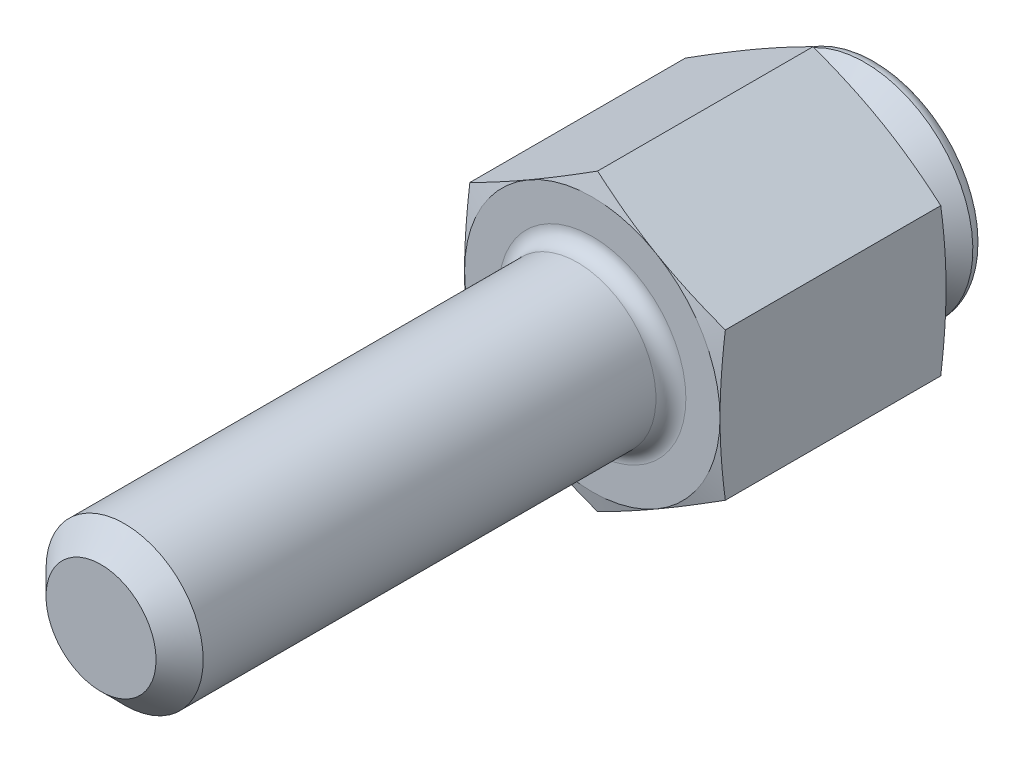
ISO-10303-21;
HEADER;
FILE_DESCRIPTION(('STEP AP214'),'2;1');
FILE_NAME('part.step','',(''),(''),'','','');
FILE_SCHEMA(('AUTOMOTIVE_DESIGN { 1 0 10303 214 1 1 1 1 }'));
ENDSEC;
DATA;
#1=APPLICATION_CONTEXT('core data for automotive mechanical design processes');
#2=APPLICATION_PROTOCOL_DEFINITION('international standard','automotive_design',2000,#1);
#3=PRODUCT_CONTEXT('',#1,'mechanical');
#4=PRODUCT('Part','Part','',(#3));
#5=PRODUCT_RELATED_PRODUCT_CATEGORY('part','',(#4));
#6=PRODUCT_DEFINITION_FORMATION('','',#4);
#7=PRODUCT_DEFINITION_CONTEXT('part definition',#1,'design');
#8=PRODUCT_DEFINITION('design','',#6,#7);
#9=PRODUCT_DEFINITION_SHAPE('','',#8);
#10=(LENGTH_UNIT() NAMED_UNIT(*) SI_UNIT(.MILLI.,.METRE.));
#11=(NAMED_UNIT(*) PLANE_ANGLE_UNIT() SI_UNIT($,.RADIAN.));
#12=(NAMED_UNIT(*) SI_UNIT($,.STERADIAN.) SOLID_ANGLE_UNIT());
#13=UNCERTAINTY_MEASURE_WITH_UNIT(LENGTH_MEASURE(1.E-05),#10,'distance_accuracy_value','');
#14=(GEOMETRIC_REPRESENTATION_CONTEXT(3) GLOBAL_UNCERTAINTY_ASSIGNED_CONTEXT((#13)) GLOBAL_UNIT_ASSIGNED_CONTEXT((#10,
#11,#12)) REPRESENTATION_CONTEXT('',''));
#15=CARTESIAN_POINT('',(0.,0.,0.));
#16=DIRECTION('',(0.,0.,1.));
#17=DIRECTION('',(1.,0.,0.));
#18=AXIS2_PLACEMENT_3D('',#15,#16,#17);
#19=CARTESIAN_POINT('',(0.,0.,4.2191999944));
#20=DIRECTION('',(0.,0.,-1.));
#21=DIRECTION('',(-1.,0.,0.));
#22=AXIS2_PLACEMENT_3D('',#19,#20,#21);
#23=PLANE('',#22);
#24=CARTESIAN_POINT('',(0.,0.,4.2191999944));
#25=DIRECTION('',(0.,0.,-1.));
#26=DIRECTION('',(-1.,0.,0.));
#27=AXIS2_PLACEMENT_3D('',#24,#25,#26);
#28=CIRCLE('',#27,5.0673);
#29=CARTESIAN_POINT('',(-5.0673,0.,4.2191999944));
#30=VERTEX_POINT('',#29);
#31=EDGE_CURVE('E128',#30,#30,#28,.F.);
#32=ORIENTED_EDGE('',*,*,#31,.F.);
#33=EDGE_LOOP('',(#32));
#34=FACE_BOUND('',#33,.T.);
#35=CARTESIAN_POINT('',(0.,0.,4.2191999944));
#36=DIRECTION('',(0.,0.,-1.));
#37=DIRECTION('',(-0.968186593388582,-0.250229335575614,0.));
#38=AXIS2_PLACEMENT_3D('',#35,#36,#37);
#39=CIRCLE('',#38,4.44877097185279);
#40=CARTESIAN_POINT('',(-1.1132130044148,4.30724041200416,4.2191999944));
#41=VERTEX_POINT('',#40);
#42=EDGE_CURVE('E9',#41,#41,#39,.T.);
#43=ORIENTED_EDGE('',*,*,#42,.F.);
#44=EDGE_LOOP('',(#43));
#45=FACE_BOUND('',#44,.T.);
#46=ADVANCED_FACE('F14',(#34,#45),#23,.T.);
#47=CARTESIAN_POINT('',(0.,0.,8.4355999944));
#48=DIRECTION('',(0.,0.,-1.));
#49=DIRECTION('',(-1.,0.,0.));
#50=AXIS2_PLACEMENT_3D('',#47,#48,#49);
#51=CYLINDRICAL_SURFACE('',#50,5.0673);
#52=ORIENTED_EDGE('',*,*,#31,.T.);
#53=EDGE_LOOP('',(#52));
#54=FACE_BOUND('',#53,.T.);
#55=CARTESIAN_POINT('',(0.,0.,3.2539999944));
#56=DIRECTION('',(0.,0.,-1.));
#57=DIRECTION('',(-1.,0.,0.));
#58=AXIS2_PLACEMENT_3D('',#55,#56,#57);
#59=CIRCLE('',#58,5.0673);
#60=CARTESIAN_POINT('',(-5.0673,0.,3.2539999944));
#61=VERTEX_POINT('',#60);
#62=EDGE_CURVE('E120',#61,#61,#59,.T.);
#63=ORIENTED_EDGE('',*,*,#62,.T.);
#64=EDGE_LOOP('',(#63));
#65=FACE_BOUND('',#64,.T.);
#66=ADVANCED_FACE('F158',(#54,#65),#51,.F.);
#67=CARTESIAN_POINT('',(0.,0.,3.2539999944));
#68=DIRECTION('',(0.,0.,-1.));
#69=DIRECTION('',(-1.,0.,0.));
#70=AXIS2_PLACEMENT_3D('',#67,#68,#69);
#71=CONICAL_SURFACE('',#70,5.0673,0.785398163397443);
#72=CARTESIAN_POINT('',(0.,0.,2.9999999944));
#73=DIRECTION('',(0.,0.,-1.));
#74=DIRECTION('',(-1.,0.,0.));
#75=AXIS2_PLACEMENT_3D('',#72,#73,#74);
#76=CIRCLE('',#75,5.3213);
#77=CARTESIAN_POINT('',(-5.3213,0.,2.9999999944));
#78=VERTEX_POINT('',#77);
#79=EDGE_CURVE('E255',#78,#78,#76,.F.);
#80=ORIENTED_EDGE('',*,*,#79,.F.);
#81=EDGE_LOOP('',(#80));
#82=FACE_BOUND('',#81,.T.);
#83=ORIENTED_EDGE('',*,*,#62,.F.);
#84=EDGE_LOOP('',(#83));
#85=FACE_BOUND('',#84,.T.);
#86=ADVANCED_FACE('F369',(#82,#85),#71,.F.);
#87=CARTESIAN_POINT('',(-6.5,3.75277674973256,2.9999999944));
#88=DIRECTION('',(0.,0.,-1.));
#89=DIRECTION('',(-1.,0.,0.));
#90=AXIS2_PLACEMENT_3D('',#87,#88,#89);
#91=PLANE('',#90);
#92=ORIENTED_EDGE('',*,*,#79,.T.);
#93=EDGE_LOOP('',(#92));
#94=FACE_BOUND('',#93,.T.);
#95=CARTESIAN_POINT('',(0.,0.,2.9999999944));
#96=DIRECTION('',(0.,0.,-1.));
#97=DIRECTION('',(-1.,0.,0.));
#98=AXIS2_PLACEMENT_3D('',#95,#96,#97);
#99=CIRCLE('',#98,6.5);
#100=CARTESIAN_POINT('',(-3.25,-5.62916512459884,2.9999999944));
#101=VERTEX_POINT('',#100);
#102=CARTESIAN_POINT('',(-6.5,0.,2.9999999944));
#103=VERTEX_POINT('',#102);
#104=EDGE_CURVE('E123',#101,#103,#99,.T.);
#105=ORIENTED_EDGE('',*,*,#104,.T.);
#106=CARTESIAN_POINT('',(0.,0.,2.9999999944));
#107=DIRECTION('',(0.,0.,-1.));
#108=DIRECTION('',(-1.,0.,0.));
#109=AXIS2_PLACEMENT_3D('',#106,#107,#108);
#110=CIRCLE('',#109,6.5);
#111=CARTESIAN_POINT('',(-3.25,5.62916512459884,2.9999999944));
#112=VERTEX_POINT('',#111);
#113=EDGE_CURVE('E31',#103,#112,#110,.T.);
#114=ORIENTED_EDGE('',*,*,#113,.T.);
#115=CARTESIAN_POINT('',(3.25,5.62916512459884,2.9999999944));
#116=VERTEX_POINT('',#115);
#117=EDGE_CURVE('E112',#112,#116,#99,.T.);
#118=ORIENTED_EDGE('',*,*,#117,.T.);
#119=CARTESIAN_POINT('',(6.5,0.,2.9999999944));
#120=VERTEX_POINT('',#119);
#121=EDGE_CURVE('E121',#116,#120,#99,.T.);
#122=ORIENTED_EDGE('',*,*,#121,.T.);
#123=CARTESIAN_POINT('',(3.25,-5.62916512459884,2.9999999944));
#124=VERTEX_POINT('',#123);
#125=EDGE_CURVE('E427',#120,#124,#99,.T.);
#126=ORIENTED_EDGE('',*,*,#125,.T.);
#127=EDGE_CURVE('E252',#124,#101,#99,.T.);
#128=ORIENTED_EDGE('',*,*,#127,.T.);
#129=EDGE_LOOP('',(#105,#114,#118,#122,#126,#128));
#130=FACE_BOUND('',#129,.T.);
#131=ADVANCED_FACE('F125',(#94,#130),#91,.T.);
#132=CARTESIAN_POINT('',(0.,0.,2.9999999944));
#133=DIRECTION('',(0.,0.,1.));
#134=DIRECTION('',(1.,0.,0.));
#135=AXIS2_PLACEMENT_3D('',#132,#133,#134);
#136=CONICAL_SURFACE('',#135,6.5,1.30899693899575);
#137=ORIENTED_EDGE('',*,*,#121,.F.);
#138=CARTESIAN_POINT('',(6.5002,3.75266127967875,3.26946818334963));
#139=CARTESIAN_POINT('',(6.23025475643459,3.90851423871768,3.22768978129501));
#140=CARTESIAN_POINT('',(5.95982006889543,4.06464977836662,3.18976187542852));
#141=CARTESIAN_POINT('',(5.41799562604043,4.37747226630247,3.12312608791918));
#142=CARTESIAN_POINT('',(5.14660552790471,4.53415941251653,3.09442195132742));
#143=CARTESIAN_POINT('',(4.6045157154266,4.84713511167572,3.04790944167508));
#144=CARTESIAN_POINT('',(4.33381966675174,5.00342154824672,3.03004560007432));
#145=CARTESIAN_POINT('',(3.79208236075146,5.31619372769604,3.00609201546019));
#146=CARTESIAN_POINT('',(3.52104118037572,5.47267942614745,2.9999999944));
#147=CARTESIAN_POINT('',(2.97895881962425,5.78565082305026,2.9999999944));
#148=CARTESIAN_POINT('',(2.70791763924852,5.94213652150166,3.00609201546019));
#149=CARTESIAN_POINT('',(2.16618033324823,6.25490870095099,3.03004560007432));
#150=CARTESIAN_POINT('',(1.89548428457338,6.41119513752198,3.04790944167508));
#151=CARTESIAN_POINT('',(1.35339447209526,6.72417083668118,3.09442195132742));
#152=CARTESIAN_POINT('',(1.08200437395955,6.88085798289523,3.12312608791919));
#153=CARTESIAN_POINT('',(0.540179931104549,7.19368047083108,3.18976187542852));
#154=CARTESIAN_POINT('',(0.269745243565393,7.34981601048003,3.22768978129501));
#155=CARTESIAN_POINT('',(-0.000200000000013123,7.50566896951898,3.26946818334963));
#156=B_SPLINE_CURVE_WITH_KNOTS('',3,(#138,#139,#140,#141,#142,#143,#144,#145,#146,#147,#148,
#149,#150,#151,#152,#153,#154,#155),.UNSPECIFIED.,.F.,.F.,(4,2,2,2,2,2,2,2,4),(0.,
0.943529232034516,1.88744107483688,2.82648138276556,3.76533995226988,4.70419852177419,
5.64323882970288,6.58715067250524,7.53067990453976),.UNSPECIFIED.);
#157=CARTESIAN_POINT('',(6.5,3.75277674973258,3.26943724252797));
#158=VERTEX_POINT('',#157);
#159=EDGE_CURVE('E135',#158,#116,#156,.T.);
#160=ORIENTED_EDGE('',*,*,#159,.F.);
#161=CARTESIAN_POINT('',(6.5,-10.0044654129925,4.45512613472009));
#162=CARTESIAN_POINT('',(6.50000000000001,-9.70867848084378,4.38868337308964));
#163=CARTESIAN_POINT('',(6.50000000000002,-9.412708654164,4.32304045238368));
#164=CARTESIAN_POINT('',(6.50000000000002,-8.82031321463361,4.19378618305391));
#165=CARTESIAN_POINT('',(6.50000000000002,-8.523887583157,4.13017491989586));
#166=CARTESIAN_POINT('',(6.50000000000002,-7.9302364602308,4.0053628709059));
#167=CARTESIAN_POINT('',(6.50000000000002,-7.63301047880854,3.94416440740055));
#168=CARTESIAN_POINT('',(6.50000000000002,-7.03794541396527,3.82482619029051));
#169=CARTESIAN_POINT('',(6.50000000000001,-6.74010633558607,3.76668641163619));
#170=CARTESIAN_POINT('',(6.50000000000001,-6.14610081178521,3.65464722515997));
#171=CARTESIAN_POINT('',(6.50000000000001,-5.8499401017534,3.6007175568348));
#172=CARTESIAN_POINT('',(6.50000000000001,-5.25681519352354,3.49748246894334));
#173=CARTESIAN_POINT('',(6.50000000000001,-4.95985101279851,3.44817694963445));
#174=CARTESIAN_POINT('',(6.50000000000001,-4.36505179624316,3.3552838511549));
#175=CARTESIAN_POINT('',(6.50000000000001,-4.06721684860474,3.31169571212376));
#176=CARTESIAN_POINT('',(6.50000000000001,-3.47059684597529,3.23150777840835));
#177=CARTESIAN_POINT('',(6.5,-3.17181178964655,3.19490799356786));
#178=CARTESIAN_POINT('',(6.5,-2.56988519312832,3.12971568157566));
#179=CARTESIAN_POINT('',(6.50000000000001,-2.26673301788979,3.10121990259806));
#180=CARTESIAN_POINT('',(6.50000000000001,-1.65965008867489,3.0541914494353));
#181=CARTESIAN_POINT('',(6.50000000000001,-1.3557193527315,3.03565854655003));
#182=CARTESIAN_POINT('',(6.50000000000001,-0.747523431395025,3.00963573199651));
#183=CARTESIAN_POINT('',(6.50000000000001,-0.44325847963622,3.00214046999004));
#184=CARTESIAN_POINT('',(6.50000000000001,0.165338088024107,2.99865544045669));
#185=CARTESIAN_POINT('',(6.50000000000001,0.469669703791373,3.00266564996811));
#186=CARTESIAN_POINT('',(6.5,1.07910960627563,3.02196777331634));
#187=CARTESIAN_POINT('',(6.5,1.3842165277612,3.03730192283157));
#188=CARTESIAN_POINT('',(6.5,1.99372315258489,3.07837085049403));
#189=CARTESIAN_POINT('',(6.5,2.29812283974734,3.10410586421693));
#190=CARTESIAN_POINT('',(6.5,2.90621194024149,3.16465760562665));
#191=CARTESIAN_POINT('',(6.5,3.20990073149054,3.19948048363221));
#192=CARTESIAN_POINT('',(6.5,3.8162976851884,3.27673535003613));
#193=CARTESIAN_POINT('',(6.5,4.11900584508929,3.31916735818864));
#194=CARTESIAN_POINT('',(6.5,4.71530607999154,3.40902902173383));
#195=CARTESIAN_POINT('',(6.5,5.00892342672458,3.45629261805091));
#196=CARTESIAN_POINT('',(6.5,5.59535016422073,3.5556148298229));
#197=CARTESIAN_POINT('',(6.5,5.88815952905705,3.60767359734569));
#198=CARTESIAN_POINT('',(6.5,6.47308937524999,3.71567333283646));
#199=CARTESIAN_POINT('',(6.5,6.7652097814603,3.77161470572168));
#200=CARTESIAN_POINT('',(6.49999999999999,7.3488323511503,3.88664229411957));
#201=CARTESIAN_POINT('',(6.49999999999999,7.64033450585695,3.94572855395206));
#202=CARTESIAN_POINT('',(6.49999999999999,8.51421406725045,4.12682171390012));
#203=CARTESIAN_POINT('',(6.49999999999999,9.0958022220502,4.25263228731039));
#204=CARTESIAN_POINT('',(6.49999999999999,10.2574156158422,4.51102121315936));
#205=CARTESIAN_POINT('',(6.49999999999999,10.8374409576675,4.64359910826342));
#206=CARTESIAN_POINT('',(6.49999999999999,11.9903925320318,4.91207172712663));
#207=CARTESIAN_POINT('',(6.49999999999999,12.5633300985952,5.04791790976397));
#208=CARTESIAN_POINT('',(6.49999999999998,13.7084200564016,5.32292192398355));
#209=CARTESIAN_POINT('',(6.49999999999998,14.2805724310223,5.46207982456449));
#210=CARTESIAN_POINT('',(6.49999999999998,15.4235044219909,5.74263306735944));
#211=CARTESIAN_POINT('',(6.49999999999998,15.9942848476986,5.88402511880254));
#212=CARTESIAN_POINT('',(6.49999999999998,17.1353614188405,6.16866615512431));
#213=CARTESIAN_POINT('',(6.49999999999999,17.7056575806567,6.31191507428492));
#214=CARTESIAN_POINT('',(6.5,18.2757873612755,6.45581528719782));
#215=B_SPLINE_CURVE_WITH_KNOTS('',3,(#161,#162,#163,#164,#165,#166,#167,#168,#169,#170,#171,
#172,#173,#174,#175,#176,#177,#178,#179,#180,#181,#182,#183,#184,#185,#186,#187,#188,#189,#190,
#191,#192,#193,#194,#195,#196,#197,#198,#199,#200,#201,#202,#203,#204,#205,#206,#207,#208,#209,
#210,#211,#212,#213,#214),.UNSPECIFIED.,.F.,.F.,(4,2,2,2,2,2,2,2,2,2,2,2,2,2,2,2,2,2,2,2,2,2,2,
2,2,2,4),(0.,0.909476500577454,1.81899120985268,2.72936096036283,3.63972325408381,
4.54278656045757,5.44583038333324,6.34878571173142,7.25174231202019,8.1650649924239,
9.07836670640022,9.991225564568,10.9040826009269,11.8203616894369,12.7366615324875,
13.6535831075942,14.5705070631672,15.4626502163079,16.3548216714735,17.2470863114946,
18.1393635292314,19.9244135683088,21.7093431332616,23.4757957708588,25.2422852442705,
27.0063787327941,28.7704099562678),.UNSPECIFIED.);
#216=EDGE_CURVE('E169',#120,#158,#215,.T.);
#217=ORIENTED_EDGE('',*,*,#216,.F.);
#218=EDGE_LOOP('',(#137,#160,#217));
#219=FACE_BOUND('',#218,.T.);
#220=ADVANCED_FACE('F157',(#219),#136,.T.);
#221=ORIENTED_EDGE('',*,*,#125,.F.);
#222=CARTESIAN_POINT('',(6.5,-3.75277674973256,3.26943724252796));
#223=VERTEX_POINT('',#222);
#224=EDGE_CURVE('E415',#223,#120,#215,.T.);
#225=ORIENTED_EDGE('',*,*,#224,.F.);
#226=CARTESIAN_POINT('',(-0.000200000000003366,-7.50566896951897,3.26946818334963));
#227=CARTESIAN_POINT('',(0.269745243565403,-7.34981601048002,3.22768978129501));
#228=CARTESIAN_POINT('',(0.54017993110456,-7.19368047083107,3.18976187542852));
#229=CARTESIAN_POINT('',(1.08200437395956,-6.88085798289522,3.12312608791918));
#230=CARTESIAN_POINT('',(1.35339447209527,-6.72417083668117,3.09442195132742));
#231=CARTESIAN_POINT('',(1.89548428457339,-6.41119513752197,3.04790944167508));
#232=CARTESIAN_POINT('',(2.16618033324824,-6.25490870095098,3.03004560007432));
#233=CARTESIAN_POINT('',(2.70791763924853,-5.94213652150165,3.00609201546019));
#234=CARTESIAN_POINT('',(2.97895881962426,-5.78565082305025,2.9999999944));
#235=CARTESIAN_POINT('',(3.52104118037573,-5.47267942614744,2.9999999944));
#236=CARTESIAN_POINT('',(3.79208236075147,-5.31619372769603,3.00609201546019));
#237=CARTESIAN_POINT('',(4.33381966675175,-5.0034215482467,3.03004560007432));
#238=CARTESIAN_POINT('',(4.60451571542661,-4.84713511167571,3.04790944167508));
#239=CARTESIAN_POINT('',(5.14660552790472,-4.53415941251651,3.09442195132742));
#240=CARTESIAN_POINT('',(5.41799562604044,-4.37747226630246,3.12312608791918));
#241=CARTESIAN_POINT('',(5.95982006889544,-4.06464977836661,3.18976187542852));
#242=CARTESIAN_POINT('',(6.23025475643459,-3.90851423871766,3.22768978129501));
#243=CARTESIAN_POINT('',(6.5002,-3.75266127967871,3.26946818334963));
#244=B_SPLINE_CURVE_WITH_KNOTS('',3,(#226,#227,#228,#229,#230,#231,#232,#233,#234,#235,#236,
#237,#238,#239,#240,#241,#242,#243),.UNSPECIFIED.,.F.,.F.,(4,2,2,2,2,2,2,2,4),(0.,
0.943529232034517,1.88744107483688,2.82648138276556,3.76533995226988,4.7041985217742,
5.64323882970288,6.58715067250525,7.53067990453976),.UNSPECIFIED.);
#245=EDGE_CURVE('E176',#124,#223,#244,.T.);
#246=ORIENTED_EDGE('',*,*,#245,.F.);
#247=EDGE_LOOP('',(#221,#225,#246));
#248=FACE_BOUND('',#247,.T.);
#249=ADVANCED_FACE('F570',(#248),#136,.T.);
#250=ORIENTED_EDGE('',*,*,#127,.F.);
#251=CARTESIAN_POINT('',(0.,-7.50555349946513,3.26943724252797));
#252=VERTEX_POINT('',#251);
#253=EDGE_CURVE('E191',#252,#124,#244,.T.);
#254=ORIENTED_EDGE('',*,*,#253,.F.);
#255=CARTESIAN_POINT('',(-6.5002,-3.75266127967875,3.26946818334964));
#256=CARTESIAN_POINT('',(-6.23025475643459,-3.90851423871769,3.22768978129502));
#257=CARTESIAN_POINT('',(-5.95982006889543,-4.06464977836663,3.18976187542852));
#258=CARTESIAN_POINT('',(-5.41799562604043,-4.37747226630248,3.12312608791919));
#259=CARTESIAN_POINT('',(-5.14660552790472,-4.53415941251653,3.09442195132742));
#260=CARTESIAN_POINT('',(-4.60451571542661,-4.84713511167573,3.04790944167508));
#261=CARTESIAN_POINT('',(-4.33381966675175,-5.00342154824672,3.03004560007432));
#262=CARTESIAN_POINT('',(-3.79208236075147,-5.31619372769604,3.0060920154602));
#263=CARTESIAN_POINT('',(-3.52104118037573,-5.47267942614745,2.9999999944));
#264=CARTESIAN_POINT('',(-2.97895881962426,-5.78565082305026,2.9999999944));
#265=CARTESIAN_POINT('',(-2.70791763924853,-5.94213652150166,3.0060920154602));
#266=CARTESIAN_POINT('',(-2.16618033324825,-6.25490870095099,3.03004560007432));
#267=CARTESIAN_POINT('',(-1.89548428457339,-6.41119513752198,3.04790944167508));
#268=CARTESIAN_POINT('',(-1.35339447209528,-6.72417083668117,3.09442195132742));
#269=CARTESIAN_POINT('',(-1.08200437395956,-6.88085798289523,3.12312608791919));
#270=CARTESIAN_POINT('',(-0.540179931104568,-7.19368047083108,3.18976187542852));
#271=CARTESIAN_POINT('',(-0.269745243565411,-7.34981601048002,3.22768978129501));
#272=CARTESIAN_POINT('',(0.000199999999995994,-7.50566896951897,3.26946818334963));
#273=B_SPLINE_CURVE_WITH_KNOTS('',3,(#255,#256,#257,#258,#259,#260,#261,#262,#263,#264,#265,
#266,#267,#268,#269,#270,#271,#272),.UNSPECIFIED.,.F.,.F.,(4,2,2,2,2,2,2,2,4),(0.,
0.943529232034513,1.88744107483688,2.82648138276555,3.76533995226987,4.70419852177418,
5.64323882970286,6.58715067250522,7.53067990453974),.UNSPECIFIED.);
#274=EDGE_CURVE('E183',#101,#252,#273,.T.);
#275=ORIENTED_EDGE('',*,*,#274,.F.);
#276=EDGE_LOOP('',(#250,#254,#275));
#277=FACE_BOUND('',#276,.T.);
#278=ADVANCED_FACE('F562',(#277),#136,.T.);
#279=ORIENTED_EDGE('',*,*,#104,.F.);
#280=CARTESIAN_POINT('',(-6.5,-3.75277674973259,3.26943724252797));
#281=VERTEX_POINT('',#280);
#282=EDGE_CURVE('E190',#281,#101,#273,.T.);
#283=ORIENTED_EDGE('',*,*,#282,.F.);
#284=CARTESIAN_POINT('',(-6.5,-10.0044654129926,4.4551261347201));
#285=CARTESIAN_POINT('',(-6.49999999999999,-9.70867848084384,4.38868337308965));
#286=CARTESIAN_POINT('',(-6.49999999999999,-9.41270865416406,4.32304045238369));
#287=CARTESIAN_POINT('',(-6.49999999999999,-8.82031321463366,4.19378618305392));
#288=CARTESIAN_POINT('',(-6.49999999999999,-8.52388758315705,4.13017491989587));
#289=CARTESIAN_POINT('',(-6.49999999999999,-7.93023646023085,4.0053628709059));
#290=CARTESIAN_POINT('',(-6.49999999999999,-7.63301047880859,3.94416440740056));
#291=CARTESIAN_POINT('',(-6.49999999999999,-7.03794541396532,3.82482619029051));
#292=CARTESIAN_POINT('',(-6.5,-6.74010633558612,3.76668641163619));
#293=CARTESIAN_POINT('',(-6.5,-6.14610081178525,3.65464722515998));
#294=CARTESIAN_POINT('',(-6.5,-5.84994010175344,3.60071755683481));
#295=CARTESIAN_POINT('',(-6.5,-5.25681519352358,3.49748246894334));
#296=CARTESIAN_POINT('',(-6.5,-4.95985101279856,3.44817694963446));
#297=CARTESIAN_POINT('',(-6.5,-4.3650517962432,3.35528385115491));
#298=CARTESIAN_POINT('',(-6.5,-4.06721684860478,3.31169571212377));
#299=CARTESIAN_POINT('',(-6.5,-3.47059684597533,3.23150777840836));
#300=CARTESIAN_POINT('',(-6.5,-3.17181178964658,3.19490799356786));
#301=CARTESIAN_POINT('',(-6.5,-2.56988519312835,3.12971568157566));
#302=CARTESIAN_POINT('',(-6.5,-2.26673301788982,3.10121990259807));
#303=CARTESIAN_POINT('',(-6.5,-1.65965008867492,3.05419144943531));
#304=CARTESIAN_POINT('',(-6.5,-1.35571935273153,3.03565854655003));
#305=CARTESIAN_POINT('',(-6.5,-0.747523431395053,3.00963573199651));
#306=CARTESIAN_POINT('',(-6.5,-0.443258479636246,3.00214046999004));
#307=CARTESIAN_POINT('',(-6.50000000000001,0.165338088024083,2.99865544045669));
#308=CARTESIAN_POINT('',(-6.50000000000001,0.46966970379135,3.00266564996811));
#309=CARTESIAN_POINT('',(-6.50000000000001,1.07910960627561,3.02196777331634));
#310=CARTESIAN_POINT('',(-6.50000000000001,1.38421652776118,3.03730192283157));
#311=CARTESIAN_POINT('',(-6.50000000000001,1.99372315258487,3.07837085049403));
#312=CARTESIAN_POINT('',(-6.50000000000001,2.29812283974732,3.10410586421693));
#313=CARTESIAN_POINT('',(-6.50000000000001,2.90621194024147,3.16465760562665));
#314=CARTESIAN_POINT('',(-6.50000000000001,3.20990073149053,3.19948048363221));
#315=CARTESIAN_POINT('',(-6.50000000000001,3.81629768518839,3.27673535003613));
#316=CARTESIAN_POINT('',(-6.5,4.11900584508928,3.31916735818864));
#317=CARTESIAN_POINT('',(-6.5,4.71530607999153,3.40902902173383));
#318=CARTESIAN_POINT('',(-6.50000000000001,5.00892342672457,3.45629261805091));
#319=CARTESIAN_POINT('',(-6.50000000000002,5.59535016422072,3.5556148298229));
#320=CARTESIAN_POINT('',(-6.50000000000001,5.88815952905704,3.60767359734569));
#321=CARTESIAN_POINT('',(-6.50000000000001,6.47308937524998,3.71567333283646));
#322=CARTESIAN_POINT('',(-6.50000000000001,6.76520978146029,3.77161470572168));
#323=CARTESIAN_POINT('',(-6.50000000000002,7.34883235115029,3.88664229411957));
#324=CARTESIAN_POINT('',(-6.50000000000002,7.64033450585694,3.94572855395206));
#325=CARTESIAN_POINT('',(-6.50000000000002,8.51421406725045,4.12682171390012));
#326=CARTESIAN_POINT('',(-6.50000000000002,9.0958022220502,4.25263228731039));
#327=CARTESIAN_POINT('',(-6.50000000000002,10.2574156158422,4.51102121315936));
#328=CARTESIAN_POINT('',(-6.50000000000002,10.8374409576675,4.64359910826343));
#329=CARTESIAN_POINT('',(-6.50000000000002,11.9903925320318,4.91207172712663));
#330=CARTESIAN_POINT('',(-6.50000000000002,12.5633300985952,5.04791790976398));
#331=CARTESIAN_POINT('',(-6.50000000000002,13.7084200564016,5.32292192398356));
#332=CARTESIAN_POINT('',(-6.50000000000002,14.2805724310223,5.46207982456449));
#333=CARTESIAN_POINT('',(-6.50000000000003,15.4235044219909,5.74263306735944));
#334=CARTESIAN_POINT('',(-6.50000000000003,15.9942848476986,5.88402511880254));
#335=CARTESIAN_POINT('',(-6.50000000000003,17.1353614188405,6.16866615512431));
#336=CARTESIAN_POINT('',(-6.50000000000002,17.7056575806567,6.31191507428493));
#337=CARTESIAN_POINT('',(-6.5,18.2757873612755,6.45581528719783));
#338=B_SPLINE_CURVE_WITH_KNOTS('',3,(#284,#285,#286,#287,#288,#289,#290,#291,#292,#293,#294,
#295,#296,#297,#298,#299,#300,#301,#302,#303,#304,#305,#306,#307,#308,#309,#310,#311,#312,#313,
#314,#315,#316,#317,#318,#319,#320,#321,#322,#323,#324,#325,#326,#327,#328,#329,#330,#331,#332,
#333,#334,#335,#336,#337),.UNSPECIFIED.,.F.,.F.,(4,2,2,2,2,2,2,2,2,2,2,2,2,2,2,2,2,2,2,2,2,2,2,
2,2,2,4),(0.,0.909476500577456,1.81899120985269,2.72936096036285,3.63972325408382,
4.54278656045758,5.44583038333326,6.34878571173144,7.25174231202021,8.16506499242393,
9.07836670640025,9.99122556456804,10.9040826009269,11.820361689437,12.7366615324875,
13.6535831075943,14.5705070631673,15.462650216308,16.3548216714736,17.2470863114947,
18.1393635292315,19.9244135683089,21.7093431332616,23.4757957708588,25.2422852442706,
27.0063787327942,28.7704099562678),.UNSPECIFIED.);
#339=EDGE_CURVE('E192',#103,#281,#338,.F.);
#340=ORIENTED_EDGE('',*,*,#339,.F.);
#341=EDGE_LOOP('',(#279,#283,#340));
#342=FACE_BOUND('',#341,.T.);
#343=ADVANCED_FACE('F554',(#342),#136,.T.);
#344=CARTESIAN_POINT('',(0.000199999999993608,7.50566896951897,3.26946818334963));
#345=CARTESIAN_POINT('',(-0.269745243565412,7.34981601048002,3.22768978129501));
#346=CARTESIAN_POINT('',(-0.540179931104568,7.19368047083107,3.18976187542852));
#347=CARTESIAN_POINT('',(-1.08200437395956,6.88085798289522,3.12312608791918));
#348=CARTESIAN_POINT('',(-1.35339447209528,6.72417083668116,3.09442195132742));
#349=CARTESIAN_POINT('',(-1.89548428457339,6.41119513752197,3.04790944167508));
#350=CARTESIAN_POINT('',(-2.16618033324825,6.25490870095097,3.03004560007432));
#351=CARTESIAN_POINT('',(-2.70791763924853,5.94213652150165,3.00609201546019));
#352=CARTESIAN_POINT('',(-2.97895881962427,5.78565082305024,2.9999999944));
#353=CARTESIAN_POINT('',(-3.52104118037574,5.47267942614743,2.9999999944));
#354=CARTESIAN_POINT('',(-3.79208236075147,5.31619372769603,3.00609201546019));
#355=CARTESIAN_POINT('',(-4.33381966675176,5.0034215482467,3.03004560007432));
#356=CARTESIAN_POINT('',(-4.60451571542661,4.84713511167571,3.04790944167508));
#357=CARTESIAN_POINT('',(-5.14660552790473,4.53415941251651,3.09442195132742));
#358=CARTESIAN_POINT('',(-5.41799562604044,4.37747226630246,3.12312608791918));
#359=CARTESIAN_POINT('',(-5.95982006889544,4.06464977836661,3.18976187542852));
#360=CARTESIAN_POINT('',(-6.23025475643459,3.90851423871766,3.22768978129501));
#361=CARTESIAN_POINT('',(-6.5002,3.75266127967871,3.26946818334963));
#362=B_SPLINE_CURVE_WITH_KNOTS('',3,(#344,#345,#346,#347,#348,#349,#350,#351,#352,#353,#354,
#355,#356,#357,#358,#359,#360,#361),.UNSPECIFIED.,.F.,.F.,(4,2,2,2,2,2,2,2,4),(0.,
0.943529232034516,1.88744107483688,2.82648138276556,3.76533995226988,4.70419852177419,
5.64323882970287,6.58715067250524,7.53067990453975),.UNSPECIFIED.);
#363=CARTESIAN_POINT('',(-6.5,3.75277674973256,3.26943724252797));
#364=VERTEX_POINT('',#363);
#365=EDGE_CURVE('E101',#112,#364,#362,.T.);
#366=ORIENTED_EDGE('',*,*,#365,.F.);
#367=ORIENTED_EDGE('',*,*,#113,.F.);
#368=EDGE_CURVE('E35',#364,#103,#338,.F.);
#369=ORIENTED_EDGE('',*,*,#368,.F.);
#370=EDGE_LOOP('',(#366,#367,#369));
#371=FACE_BOUND('',#370,.T.);
#372=ADVANCED_FACE('F103',(#371),#136,.T.);
#373=ORIENTED_EDGE('',*,*,#117,.F.);
#374=CARTESIAN_POINT('',(0.,7.50555349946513,3.26943724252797));
#375=VERTEX_POINT('',#374);
#376=EDGE_CURVE('E108',#375,#112,#362,.T.);
#377=ORIENTED_EDGE('',*,*,#376,.F.);
#378=EDGE_CURVE('E115',#116,#375,#156,.T.);
#379=ORIENTED_EDGE('',*,*,#378,.F.);
#380=EDGE_LOOP('',(#373,#377,#379));
#381=FACE_BOUND('',#380,.T.);
#382=ADVANCED_FACE('F113',(#381),#136,.T.);
#383=CARTESIAN_POINT('',(0.,7.50555349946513,14.4999999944));
#384=DIRECTION('',(0.5,0.86602540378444,0.));
#385=DIRECTION('',(0.86602540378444,-0.5,0.));
#386=AXIS2_PLACEMENT_3D('',#383,#384,#385);
#387=PLANE('',#386);
#388=DIRECTION('',(0.,0.,-1.));
#389=VECTOR('',#388,1.);
#390=CARTESIAN_POINT('',(6.5,3.75277674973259,14.4999999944));
#391=LINE('',#390,#389);
#392=CARTESIAN_POINT('',(6.5,3.75277674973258,14.230562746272));
#393=VERTEX_POINT('',#392);
#394=EDGE_CURVE('E242',#393,#158,#391,.T.);
#395=ORIENTED_EDGE('',*,*,#394,.T.);
#396=ORIENTED_EDGE('',*,*,#159,.T.);
#397=ORIENTED_EDGE('',*,*,#378,.T.);
#398=DIRECTION('',(0.,0.,-1.));
#399=VECTOR('',#398,1.);
#400=CARTESIAN_POINT('',(0.,7.50555349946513,14.4999999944));
#401=LINE('',#400,#399);
#402=CARTESIAN_POINT('',(0.,7.50555349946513,14.230562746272));
#403=VERTEX_POINT('',#402);
#404=EDGE_CURVE('E134',#403,#375,#401,.T.);
#405=ORIENTED_EDGE('',*,*,#404,.F.);
#406=CARTESIAN_POINT('',(-0.000200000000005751,7.50566896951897,14.2305318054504));
#407=CARTESIAN_POINT('',(0.269745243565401,7.34981601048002,14.272310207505));
#408=CARTESIAN_POINT('',(0.540179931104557,7.19368047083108,14.3102381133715));
#409=CARTESIAN_POINT('',(1.08200437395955,6.88085798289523,14.3768739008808));
#410=CARTESIAN_POINT('',(1.35339447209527,6.72417083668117,14.4055780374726));
#411=CARTESIAN_POINT('',(1.89548428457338,6.41119513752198,14.4520905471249));
#412=CARTESIAN_POINT('',(2.16618033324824,6.25490870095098,14.4699543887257));
#413=CARTESIAN_POINT('',(2.70791763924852,5.94213652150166,14.4939079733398));
#414=CARTESIAN_POINT('',(2.97895881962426,5.78565082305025,14.4999999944));
#415=CARTESIAN_POINT('',(3.52104118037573,5.47267942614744,14.4999999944));
#416=CARTESIAN_POINT('',(3.79208236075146,5.31619372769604,14.4939079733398));
#417=CARTESIAN_POINT('',(4.33381966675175,5.00342154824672,14.4699543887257));
#418=CARTESIAN_POINT('',(4.6045157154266,4.84713511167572,14.4520905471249));
#419=CARTESIAN_POINT('',(5.14660552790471,4.53415941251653,14.4055780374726));
#420=CARTESIAN_POINT('',(5.41799562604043,4.37747226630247,14.3768739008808));
#421=CARTESIAN_POINT('',(5.95982006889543,4.06464977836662,14.3102381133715));
#422=CARTESIAN_POINT('',(6.23025475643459,3.90851423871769,14.272310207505));
#423=CARTESIAN_POINT('',(6.5002,3.75266127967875,14.2305318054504));
#424=B_SPLINE_CURVE_WITH_KNOTS('',3,(#406,#407,#408,#409,#410,#411,#412,#413,#414,#415,#416,
#417,#418,#419,#420,#421,#422,#423),.UNSPECIFIED.,.F.,.F.,(4,2,2,2,2,2,2,2,4),(0.,
0.943529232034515,1.88744107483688,2.82648138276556,3.76533995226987,4.70419852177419,
5.64323882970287,6.58715067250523,7.53067990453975),.UNSPECIFIED.);
#425=CARTESIAN_POINT('',(3.25,5.62916512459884,14.4999999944));
#426=VERTEX_POINT('',#425);
#427=EDGE_CURVE('E384',#403,#426,#424,.T.);
#428=ORIENTED_EDGE('',*,*,#427,.T.);
#429=EDGE_CURVE('E392',#426,#393,#424,.T.);
#430=ORIENTED_EDGE('',*,*,#429,.T.);
#431=EDGE_LOOP('',(#395,#396,#397,#405,#428,#430));
#432=FACE_BOUND('',#431,.T.);
#433=ADVANCED_FACE('F156',(#432),#387,.T.);
#434=CARTESIAN_POINT('',(6.5,3.75277674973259,14.4999999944));
#435=DIRECTION('',(1.,0.,0.));
#436=DIRECTION('',(0.,-1.,0.));
#437=AXIS2_PLACEMENT_3D('',#434,#435,#436);
#438=PLANE('',#437);
#439=DIRECTION('',(0.,0.,-1.));
#440=VECTOR('',#439,1.);
#441=CARTESIAN_POINT('',(6.5,-3.75277674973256,14.4999999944));
#442=LINE('',#441,#440);
#443=CARTESIAN_POINT('',(6.5,-3.75277674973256,14.230562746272));
#444=VERTEX_POINT('',#443);
#445=EDGE_CURVE('E239',#444,#223,#442,.T.);
#446=ORIENTED_EDGE('',*,*,#445,.T.);
#447=ORIENTED_EDGE('',*,*,#224,.T.);
#448=ORIENTED_EDGE('',*,*,#216,.T.);
#449=ORIENTED_EDGE('',*,*,#394,.F.);
#450=CARTESIAN_POINT('',(6.5,-10.0044654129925,13.0448738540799));
#451=CARTESIAN_POINT('',(6.50000000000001,-9.70867848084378,13.1113166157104));
#452=CARTESIAN_POINT('',(6.50000000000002,-9.41270865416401,13.1769595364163));
#453=CARTESIAN_POINT('',(6.50000000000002,-8.82031321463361,13.3062138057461));
#454=CARTESIAN_POINT('',(6.50000000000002,-8.523887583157,13.3698250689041));
#455=CARTESIAN_POINT('',(6.50000000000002,-7.9302364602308,13.4946371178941));
#456=CARTESIAN_POINT('',(6.50000000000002,-7.63301047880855,13.5558355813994));
#457=CARTESIAN_POINT('',(6.50000000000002,-7.03794541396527,13.6751737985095));
#458=CARTESIAN_POINT('',(6.50000000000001,-6.74010633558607,13.7333135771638));
#459=CARTESIAN_POINT('',(6.50000000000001,-6.14610081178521,13.84535276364));
#460=CARTESIAN_POINT('',(6.50000000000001,-5.8499401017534,13.8992824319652));
#461=CARTESIAN_POINT('',(6.50000000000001,-5.25681519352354,14.0025175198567));
#462=CARTESIAN_POINT('',(6.50000000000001,-4.95985101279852,14.0518230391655));
#463=CARTESIAN_POINT('',(6.50000000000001,-4.36505179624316,14.1447161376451));
#464=CARTESIAN_POINT('',(6.50000000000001,-4.06721684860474,14.1883042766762));
#465=CARTESIAN_POINT('',(6.50000000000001,-3.47059684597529,14.2684922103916));
#466=CARTESIAN_POINT('',(6.5,-3.17181178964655,14.3050919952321));
#467=CARTESIAN_POINT('',(6.5,-2.56988519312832,14.3702843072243));
#468=CARTESIAN_POINT('',(6.50000000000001,-2.26673301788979,14.3987800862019));
#469=CARTESIAN_POINT('',(6.50000000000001,-1.65965008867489,14.4458085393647));
#470=CARTESIAN_POINT('',(6.50000000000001,-1.3557193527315,14.46434144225));
#471=CARTESIAN_POINT('',(6.50000000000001,-0.747523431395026,14.4903642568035));
#472=CARTESIAN_POINT('',(6.50000000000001,-0.443258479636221,14.49785951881));
#473=CARTESIAN_POINT('',(6.50000000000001,0.165338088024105,14.5013445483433));
#474=CARTESIAN_POINT('',(6.50000000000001,0.469669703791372,14.4973343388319));
#475=CARTESIAN_POINT('',(6.5,1.07910960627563,14.4780322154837));
#476=CARTESIAN_POINT('',(6.5,1.3842165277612,14.4626980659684));
#477=CARTESIAN_POINT('',(6.5,1.99372315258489,14.421629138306));
#478=CARTESIAN_POINT('',(6.5,2.29812283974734,14.3958941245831));
#479=CARTESIAN_POINT('',(6.5,2.90621194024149,14.3353423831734));
#480=CARTESIAN_POINT('',(6.5,3.20990073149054,14.3005195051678));
#481=CARTESIAN_POINT('',(6.5,3.8162976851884,14.2232646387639));
#482=CARTESIAN_POINT('',(6.5,4.11900584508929,14.1808326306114));
#483=CARTESIAN_POINT('',(6.5,4.71530607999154,14.0909709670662));
#484=CARTESIAN_POINT('',(6.5,5.00892342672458,14.0437073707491));
#485=CARTESIAN_POINT('',(6.5,5.59535016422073,13.9443851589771));
#486=CARTESIAN_POINT('',(6.5,5.88815952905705,13.8923263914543));
#487=CARTESIAN_POINT('',(6.5,6.47308937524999,13.7843266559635));
#488=CARTESIAN_POINT('',(6.5,6.76520978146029,13.7283852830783));
#489=CARTESIAN_POINT('',(6.49999999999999,7.3488323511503,13.6133576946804));
#490=CARTESIAN_POINT('',(6.49999999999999,7.64033450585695,13.5542714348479));
#491=CARTESIAN_POINT('',(6.49999999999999,8.51421406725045,13.3731782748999));
#492=CARTESIAN_POINT('',(6.49999999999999,9.0958022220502,13.2473677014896));
#493=CARTESIAN_POINT('',(6.49999999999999,10.2574156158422,12.9889787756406));
#494=CARTESIAN_POINT('',(6.49999999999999,10.8374409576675,12.8564008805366));
#495=CARTESIAN_POINT('',(6.49999999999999,11.9903925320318,12.5879282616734));
#496=CARTESIAN_POINT('',(6.49999999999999,12.5633300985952,12.452082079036));
#497=CARTESIAN_POINT('',(6.49999999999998,13.7084200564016,12.1770780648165));
#498=CARTESIAN_POINT('',(6.49999999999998,14.2805724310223,12.0379201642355));
#499=CARTESIAN_POINT('',(6.49999999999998,15.4235044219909,11.7573669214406));
#500=CARTESIAN_POINT('',(6.49999999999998,15.9942848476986,11.6159748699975));
#501=CARTESIAN_POINT('',(6.49999999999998,17.1353614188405,11.3313338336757));
#502=CARTESIAN_POINT('',(6.49999999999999,17.7056575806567,11.1880849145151));
#503=CARTESIAN_POINT('',(6.5,18.2757873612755,11.0441847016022));
#504=B_SPLINE_CURVE_WITH_KNOTS('',3,(#450,#451,#452,#453,#454,#455,#456,#457,#458,#459,#460,
#461,#462,#463,#464,#465,#466,#467,#468,#469,#470,#471,#472,#473,#474,#475,#476,#477,#478,#479,
#480,#481,#482,#483,#484,#485,#486,#487,#488,#489,#490,#491,#492,#493,#494,#495,#496,#497,#498,
#499,#500,#501,#502,#503),.UNSPECIFIED.,.F.,.F.,(4,2,2,2,2,2,2,2,2,2,2,2,2,2,2,2,2,2,2,2,2,2,2,
2,2,2,4),(0.,0.909476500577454,1.81899120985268,2.72936096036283,3.63972325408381,
4.54278656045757,5.44583038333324,6.34878571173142,7.25174231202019,8.16506499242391,
9.07836670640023,9.991225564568,10.9040826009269,11.8203616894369,12.7366615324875,
13.6535831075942,14.5705070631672,15.4626502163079,16.3548216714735,17.2470863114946,
18.1393635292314,19.9244135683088,21.7093431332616,23.4757957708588,25.2422852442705,
27.0063787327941,28.7704099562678),.UNSPECIFIED.);
#505=CARTESIAN_POINT('',(6.5,0.,14.4999999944));
#506=VERTEX_POINT('',#505);
#507=EDGE_CURVE('E217',#393,#506,#504,.F.);
#508=ORIENTED_EDGE('',*,*,#507,.T.);
#509=EDGE_CURVE('E231',#506,#444,#504,.F.);
#510=ORIENTED_EDGE('',*,*,#509,.T.);
#511=EDGE_LOOP('',(#446,#447,#448,#449,#508,#510));
#512=FACE_BOUND('',#511,.T.);
#513=ADVANCED_FACE('F400',(#512),#438,.T.);
#514=CARTESIAN_POINT('',(6.5,-3.75277674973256,14.4999999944));
#515=DIRECTION('',(0.5,-0.866025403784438,0.));
#516=DIRECTION('',(-0.866025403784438,-0.5,0.));
#517=AXIS2_PLACEMENT_3D('',#514,#515,#516);
#518=PLANE('',#517);
#519=DIRECTION('',(0.,0.,-1.));
#520=VECTOR('',#519,1.);
#521=CARTESIAN_POINT('',(0.,-7.50555349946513,14.4999999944));
#522=LINE('',#521,#520);
#523=CARTESIAN_POINT('',(0.,-7.50555349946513,14.230562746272));
#524=VERTEX_POINT('',#523);
#525=EDGE_CURVE('E236',#524,#252,#522,.T.);
#526=ORIENTED_EDGE('',*,*,#525,.T.);
#527=ORIENTED_EDGE('',*,*,#253,.T.);
#528=ORIENTED_EDGE('',*,*,#245,.T.);
#529=ORIENTED_EDGE('',*,*,#445,.F.);
#530=CARTESIAN_POINT('',(6.5002,-3.75266127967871,14.2305318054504));
#531=CARTESIAN_POINT('',(6.23025475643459,-3.90851423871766,14.272310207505));
#532=CARTESIAN_POINT('',(5.95982006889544,-4.06464977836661,14.3102381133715));
#533=CARTESIAN_POINT('',(5.41799562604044,-4.37747226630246,14.3768739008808));
#534=CARTESIAN_POINT('',(5.14660552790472,-4.53415941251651,14.4055780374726));
#535=CARTESIAN_POINT('',(4.60451571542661,-4.84713511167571,14.4520905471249));
#536=CARTESIAN_POINT('',(4.33381966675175,-5.0034215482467,14.4699543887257));
#537=CARTESIAN_POINT('',(3.79208236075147,-5.31619372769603,14.4939079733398));
#538=CARTESIAN_POINT('',(3.52104118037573,-5.47267942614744,14.4999999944));
#539=CARTESIAN_POINT('',(2.97895881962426,-5.78565082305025,14.4999999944));
#540=CARTESIAN_POINT('',(2.70791763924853,-5.94213652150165,14.4939079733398));
#541=CARTESIAN_POINT('',(2.16618033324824,-6.25490870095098,14.4699543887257));
#542=CARTESIAN_POINT('',(1.89548428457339,-6.41119513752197,14.4520905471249));
#543=CARTESIAN_POINT('',(1.35339447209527,-6.72417083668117,14.4055780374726));
#544=CARTESIAN_POINT('',(1.08200437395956,-6.88085798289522,14.3768739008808));
#545=CARTESIAN_POINT('',(0.540179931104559,-7.19368047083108,14.3102381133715));
#546=CARTESIAN_POINT('',(0.269745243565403,-7.34981601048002,14.272310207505));
#547=CARTESIAN_POINT('',(-0.000200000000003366,-7.50566896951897,14.2305318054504));
#548=B_SPLINE_CURVE_WITH_KNOTS('',3,(#530,#531,#532,#533,#534,#535,#536,#537,#538,#539,#540,
#541,#542,#543,#544,#545,#546,#547),.UNSPECIFIED.,.F.,.F.,(4,2,2,2,2,2,2,2,4),(0.,
0.943529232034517,1.88744107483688,2.82648138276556,3.76533995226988,4.7041985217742,
5.64323882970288,6.58715067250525,7.53067990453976),.UNSPECIFIED.);
#549=CARTESIAN_POINT('',(3.25,-5.62916512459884,14.4999999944));
#550=VERTEX_POINT('',#549);
#551=EDGE_CURVE('E230',#444,#550,#548,.T.);
#552=ORIENTED_EDGE('',*,*,#551,.T.);
#553=EDGE_CURVE('E223',#550,#524,#548,.T.);
#554=ORIENTED_EDGE('',*,*,#553,.T.);
#555=EDGE_LOOP('',(#526,#527,#528,#529,#552,#554));
#556=FACE_BOUND('',#555,.T.);
#557=ADVANCED_FACE('F203',(#556),#518,.T.);
#558=CARTESIAN_POINT('',(0.,-7.50555349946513,14.4999999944));
#559=DIRECTION('',(-0.5,-0.86602540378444,0.));
#560=DIRECTION('',(-0.86602540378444,0.5,0.));
#561=AXIS2_PLACEMENT_3D('',#558,#559,#560);
#562=PLANE('',#561);
#563=DIRECTION('',(0.,0.,-1.));
#564=VECTOR('',#563,1.);
#565=CARTESIAN_POINT('',(-6.5,-3.75277674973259,14.4999999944));
#566=LINE('',#565,#564);
#567=CARTESIAN_POINT('',(-6.5,-3.75277674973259,14.230562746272));
#568=VERTEX_POINT('',#567);
#569=EDGE_CURVE('E232',#568,#281,#566,.T.);
#570=ORIENTED_EDGE('',*,*,#569,.T.);
#571=ORIENTED_EDGE('',*,*,#282,.T.);
#572=ORIENTED_EDGE('',*,*,#274,.T.);
#573=ORIENTED_EDGE('',*,*,#525,.F.);
#574=CARTESIAN_POINT('',(0.000199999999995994,-7.50566896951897,14.2305318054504));
#575=CARTESIAN_POINT('',(-0.269745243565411,-7.34981601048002,14.272310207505));
#576=CARTESIAN_POINT('',(-0.540179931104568,-7.19368047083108,14.3102381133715));
#577=CARTESIAN_POINT('',(-1.08200437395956,-6.88085798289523,14.3768739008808));
#578=CARTESIAN_POINT('',(-1.35339447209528,-6.72417083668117,14.4055780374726));
#579=CARTESIAN_POINT('',(-1.89548428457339,-6.41119513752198,14.4520905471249));
#580=CARTESIAN_POINT('',(-2.16618033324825,-6.25490870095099,14.4699543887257));
#581=CARTESIAN_POINT('',(-2.70791763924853,-5.94213652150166,14.4939079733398));
#582=CARTESIAN_POINT('',(-2.97895881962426,-5.78565082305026,14.4999999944));
#583=CARTESIAN_POINT('',(-3.52104118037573,-5.47267942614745,14.4999999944));
#584=CARTESIAN_POINT('',(-3.79208236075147,-5.31619372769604,14.4939079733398));
#585=CARTESIAN_POINT('',(-4.33381966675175,-5.00342154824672,14.4699543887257));
#586=CARTESIAN_POINT('',(-4.6045157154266,-4.84713511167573,14.4520905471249));
#587=CARTESIAN_POINT('',(-5.14660552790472,-4.53415941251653,14.4055780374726));
#588=CARTESIAN_POINT('',(-5.41799562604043,-4.37747226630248,14.3768739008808));
#589=CARTESIAN_POINT('',(-5.95982006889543,-4.06464977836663,14.3102381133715));
#590=CARTESIAN_POINT('',(-6.23025475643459,-3.90851423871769,14.272310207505));
#591=CARTESIAN_POINT('',(-6.5002,-3.75266127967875,14.2305318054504));
#592=B_SPLINE_CURVE_WITH_KNOTS('',3,(#574,#575,#576,#577,#578,#579,#580,#581,#582,#583,#584,
#585,#586,#587,#588,#589,#590,#591),.UNSPECIFIED.,.F.,.F.,(4,2,2,2,2,2,2,2,4),(0.,
0.943529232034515,1.88744107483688,2.82648138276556,3.76533995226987,4.70419852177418,
5.64323882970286,6.58715067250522,7.53067990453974),.UNSPECIFIED.);
#593=CARTESIAN_POINT('',(-3.25,-5.62916512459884,14.4999999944));
#594=VERTEX_POINT('',#593);
#595=EDGE_CURVE('E216',#524,#594,#592,.T.);
#596=ORIENTED_EDGE('',*,*,#595,.T.);
#597=EDGE_CURVE('E208',#594,#568,#592,.T.);
#598=ORIENTED_EDGE('',*,*,#597,.T.);
#599=EDGE_LOOP('',(#570,#571,#572,#573,#596,#598));
#600=FACE_BOUND('',#599,.T.);
#601=ADVANCED_FACE('F198',(#600),#562,.T.);
#602=CARTESIAN_POINT('',(-6.5,-3.75277674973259,14.4999999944));
#603=DIRECTION('',(-1.,0.,0.));
#604=DIRECTION('',(0.,1.,0.));
#605=AXIS2_PLACEMENT_3D('',#602,#603,#604);
#606=PLANE('',#605);
#607=DIRECTION('',(0.,0.,-1.));
#608=VECTOR('',#607,1.);
#609=CARTESIAN_POINT('',(-6.5,3.75277674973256,14.4999999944));
#610=LINE('',#609,#608);
#611=CARTESIAN_POINT('',(-6.5,3.75277674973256,14.230562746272));
#612=VERTEX_POINT('',#611);
#613=EDGE_CURVE('E246',#612,#364,#610,.T.);
#614=ORIENTED_EDGE('',*,*,#613,.T.);
#615=ORIENTED_EDGE('',*,*,#368,.T.);
#616=ORIENTED_EDGE('',*,*,#339,.T.);
#617=ORIENTED_EDGE('',*,*,#569,.F.);
#618=CARTESIAN_POINT('',(-6.5,-10.0044654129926,13.0448738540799));
#619=CARTESIAN_POINT('',(-6.49999999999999,-9.70867848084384,13.1113166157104));
#620=CARTESIAN_POINT('',(-6.49999999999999,-9.41270865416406,13.1769595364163));
#621=CARTESIAN_POINT('',(-6.49999999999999,-8.82031321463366,13.3062138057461));
#622=CARTESIAN_POINT('',(-6.49999999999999,-8.52388758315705,13.3698250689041));
#623=CARTESIAN_POINT('',(-6.49999999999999,-7.93023646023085,13.4946371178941));
#624=CARTESIAN_POINT('',(-6.49999999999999,-7.63301047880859,13.5558355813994));
#625=CARTESIAN_POINT('',(-6.49999999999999,-7.03794541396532,13.6751737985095));
#626=CARTESIAN_POINT('',(-6.5,-6.74010633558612,13.7333135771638));
#627=CARTESIAN_POINT('',(-6.5,-6.14610081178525,13.84535276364));
#628=CARTESIAN_POINT('',(-6.5,-5.84994010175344,13.8992824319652));
#629=CARTESIAN_POINT('',(-6.5,-5.25681519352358,14.0025175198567));
#630=CARTESIAN_POINT('',(-6.5,-4.95985101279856,14.0518230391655));
#631=CARTESIAN_POINT('',(-6.5,-4.3650517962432,14.1447161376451));
#632=CARTESIAN_POINT('',(-6.5,-4.06721684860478,14.1883042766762));
#633=CARTESIAN_POINT('',(-6.5,-3.47059684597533,14.2684922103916));
#634=CARTESIAN_POINT('',(-6.5,-3.17181178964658,14.3050919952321));
#635=CARTESIAN_POINT('',(-6.5,-2.56988519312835,14.3702843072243));
#636=CARTESIAN_POINT('',(-6.5,-2.26673301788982,14.3987800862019));
#637=CARTESIAN_POINT('',(-6.5,-1.65965008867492,14.4458085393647));
#638=CARTESIAN_POINT('',(-6.5,-1.35571935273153,14.46434144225));
#639=CARTESIAN_POINT('',(-6.5,-0.747523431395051,14.4903642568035));
#640=CARTESIAN_POINT('',(-6.5,-0.443258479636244,14.49785951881));
#641=CARTESIAN_POINT('',(-6.50000000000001,0.165338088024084,14.5013445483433));
#642=CARTESIAN_POINT('',(-6.50000000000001,0.469669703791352,14.4973343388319));
#643=CARTESIAN_POINT('',(-6.50000000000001,1.07910960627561,14.4780322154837));
#644=CARTESIAN_POINT('',(-6.50000000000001,1.38421652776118,14.4626980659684));
#645=CARTESIAN_POINT('',(-6.50000000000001,1.99372315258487,14.421629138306));
#646=CARTESIAN_POINT('',(-6.50000000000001,2.29812283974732,14.3958941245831));
#647=CARTESIAN_POINT('',(-6.50000000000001,2.90621194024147,14.3353423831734));
#648=CARTESIAN_POINT('',(-6.50000000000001,3.20990073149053,14.3005195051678));
#649=CARTESIAN_POINT('',(-6.50000000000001,3.81629768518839,14.2232646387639));
#650=CARTESIAN_POINT('',(-6.5,4.11900584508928,14.1808326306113));
#651=CARTESIAN_POINT('',(-6.5,4.71530607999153,14.0909709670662));
#652=CARTESIAN_POINT('',(-6.50000000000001,5.00892342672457,14.0437073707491));
#653=CARTESIAN_POINT('',(-6.50000000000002,5.59535016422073,13.9443851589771));
#654=CARTESIAN_POINT('',(-6.50000000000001,5.88815952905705,13.8923263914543));
#655=CARTESIAN_POINT('',(-6.50000000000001,6.47308937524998,13.7843266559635));
#656=CARTESIAN_POINT('',(-6.50000000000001,6.76520978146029,13.7283852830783));
#657=CARTESIAN_POINT('',(-6.50000000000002,7.34883235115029,13.6133576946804));
#658=CARTESIAN_POINT('',(-6.50000000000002,7.64033450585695,13.5542714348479));
#659=CARTESIAN_POINT('',(-6.50000000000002,8.51421406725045,13.3731782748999));
#660=CARTESIAN_POINT('',(-6.50000000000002,9.0958022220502,13.2473677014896));
#661=CARTESIAN_POINT('',(-6.50000000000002,10.2574156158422,12.9889787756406));
#662=CARTESIAN_POINT('',(-6.50000000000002,10.8374409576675,12.8564008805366));
#663=CARTESIAN_POINT('',(-6.50000000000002,11.9903925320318,12.5879282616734));
#664=CARTESIAN_POINT('',(-6.50000000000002,12.5633300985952,12.452082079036));
#665=CARTESIAN_POINT('',(-6.50000000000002,13.7084200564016,12.1770780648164));
#666=CARTESIAN_POINT('',(-6.50000000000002,14.2805724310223,12.0379201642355));
#667=CARTESIAN_POINT('',(-6.50000000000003,15.4235044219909,11.7573669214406));
#668=CARTESIAN_POINT('',(-6.50000000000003,15.9942848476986,11.6159748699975));
#669=CARTESIAN_POINT('',(-6.50000000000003,17.1353614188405,11.3313338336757));
#670=CARTESIAN_POINT('',(-6.50000000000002,17.7056575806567,11.1880849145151));
#671=CARTESIAN_POINT('',(-6.5,18.2757873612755,11.0441847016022));
#672=B_SPLINE_CURVE_WITH_KNOTS('',3,(#618,#619,#620,#621,#622,#623,#624,#625,#626,#627,#628,
#629,#630,#631,#632,#633,#634,#635,#636,#637,#638,#639,#640,#641,#642,#643,#644,#645,#646,#647,
#648,#649,#650,#651,#652,#653,#654,#655,#656,#657,#658,#659,#660,#661,#662,#663,#664,#665,#666,
#667,#668,#669,#670,#671),.UNSPECIFIED.,.F.,.F.,(4,2,2,2,2,2,2,2,2,2,2,2,2,2,2,2,2,2,2,2,2,2,2,
2,2,2,4),(0.,0.909476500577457,1.81899120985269,2.72936096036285,3.63972325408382,
4.54278656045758,5.44583038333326,6.34878571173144,7.25174231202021,8.16506499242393,
9.07836670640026,9.99122556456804,10.9040826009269,11.820361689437,12.7366615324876,
13.6535831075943,14.5705070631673,15.462650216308,16.3548216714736,17.2470863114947,
18.1393635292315,19.9244135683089,21.7093431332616,23.4757957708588,25.2422852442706,
27.0063787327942,28.7704099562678),.UNSPECIFIED.);
#673=CARTESIAN_POINT('',(-6.5,0.,14.4999999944));
#674=VERTEX_POINT('',#673);
#675=EDGE_CURVE('E383',#568,#674,#672,.T.);
#676=ORIENTED_EDGE('',*,*,#675,.T.);
#677=EDGE_CURVE('E376',#674,#612,#672,.T.);
#678=ORIENTED_EDGE('',*,*,#677,.T.);
#679=EDGE_LOOP('',(#614,#615,#616,#617,#676,#678));
#680=FACE_BOUND('',#679,.T.);
#681=ADVANCED_FACE('F202',(#680),#606,.T.);
#682=CARTESIAN_POINT('',(-6.5,3.75277674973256,14.4999999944));
#683=DIRECTION('',(-0.5,0.866025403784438,0.));
#684=DIRECTION('',(0.866025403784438,0.5,0.));
#685=AXIS2_PLACEMENT_3D('',#682,#683,#684);
#686=PLANE('',#685);
#687=ORIENTED_EDGE('',*,*,#404,.T.);
#688=ORIENTED_EDGE('',*,*,#376,.T.);
#689=ORIENTED_EDGE('',*,*,#365,.T.);
#690=ORIENTED_EDGE('',*,*,#613,.F.);
#691=CARTESIAN_POINT('',(-6.5002,3.75266127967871,14.2305318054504));
#692=CARTESIAN_POINT('',(-6.23025475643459,3.90851423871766,14.272310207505));
#693=CARTESIAN_POINT('',(-5.95982006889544,4.06464977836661,14.3102381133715));
#694=CARTESIAN_POINT('',(-5.41799562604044,4.37747226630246,14.3768739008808));
#695=CARTESIAN_POINT('',(-5.14660552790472,4.53415941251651,14.4055780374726));
#696=CARTESIAN_POINT('',(-4.60451571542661,4.84713511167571,14.4520905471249));
#697=CARTESIAN_POINT('',(-4.33381966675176,5.0034215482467,14.4699543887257));
#698=CARTESIAN_POINT('',(-3.79208236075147,5.31619372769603,14.4939079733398));
#699=CARTESIAN_POINT('',(-3.52104118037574,5.47267942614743,14.4999999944));
#700=CARTESIAN_POINT('',(-2.97895881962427,5.78565082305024,14.4999999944));
#701=CARTESIAN_POINT('',(-2.70791763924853,5.94213652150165,14.4939079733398));
#702=CARTESIAN_POINT('',(-2.16618033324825,6.25490870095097,14.4699543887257));
#703=CARTESIAN_POINT('',(-1.89548428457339,6.41119513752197,14.4520905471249));
#704=CARTESIAN_POINT('',(-1.35339447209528,6.72417083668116,14.4055780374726));
#705=CARTESIAN_POINT('',(-1.08200437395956,6.88085798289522,14.3768739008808));
#706=CARTESIAN_POINT('',(-0.540179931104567,7.19368047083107,14.3102381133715));
#707=CARTESIAN_POINT('',(-0.269745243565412,7.34981601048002,14.272310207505));
#708=CARTESIAN_POINT('',(0.000199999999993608,7.50566896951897,14.2305318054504));
#709=B_SPLINE_CURVE_WITH_KNOTS('',3,(#691,#692,#693,#694,#695,#696,#697,#698,#699,#700,#701,
#702,#703,#704,#705,#706,#707,#708),.UNSPECIFIED.,.F.,.F.,(4,2,2,2,2,2,2,2,4),(0.,
0.943529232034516,1.88744107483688,2.82648138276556,3.76533995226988,4.70419852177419,
5.64323882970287,6.58715067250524,7.53067990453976),.UNSPECIFIED.);
#710=CARTESIAN_POINT('',(-3.25,5.62916512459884,14.4999999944));
#711=VERTEX_POINT('',#710);
#712=EDGE_CURVE('E391',#612,#711,#709,.T.);
#713=ORIENTED_EDGE('',*,*,#712,.T.);
#714=EDGE_CURVE('E393',#711,#403,#709,.T.);
#715=ORIENTED_EDGE('',*,*,#714,.T.);
#716=EDGE_LOOP('',(#687,#688,#689,#690,#713,#715));
#717=FACE_BOUND('',#716,.T.);
#718=ADVANCED_FACE('F131',(#717),#686,.T.);
#719=CARTESIAN_POINT('',(0.,0.,13.0858363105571));
#720=DIRECTION('',(0.,0.,-1.));
#721=DIRECTION('',(-1.,0.,0.));
#722=AXIS2_PLACEMENT_3D('',#719,#720,#721);
#723=CONICAL_SURFACE('',#722,11.7777307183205,1.30899693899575);
#724=ORIENTED_EDGE('',*,*,#714,.F.);
#725=CARTESIAN_POINT('',(0.,0.,14.4999999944));
#726=DIRECTION('',(0.,0.,-1.));
#727=DIRECTION('',(-1.,0.,0.));
#728=AXIS2_PLACEMENT_3D('',#725,#726,#727);
#729=CIRCLE('',#728,6.5);
#730=EDGE_CURVE('E250',#711,#426,#729,.T.);
#731=ORIENTED_EDGE('',*,*,#730,.T.);
#732=ORIENTED_EDGE('',*,*,#427,.F.);
#733=EDGE_LOOP('',(#724,#731,#732));
#734=FACE_BOUND('',#733,.T.);
#735=ADVANCED_FACE('F160',(#734),#723,.T.);
#736=ORIENTED_EDGE('',*,*,#429,.F.);
#737=EDGE_CURVE('E456',#426,#506,#729,.T.);
#738=ORIENTED_EDGE('',*,*,#737,.T.);
#739=ORIENTED_EDGE('',*,*,#507,.F.);
#740=EDGE_LOOP('',(#736,#738,#739));
#741=FACE_BOUND('',#740,.T.);
#742=ADVANCED_FACE('F462',(#741),#723,.T.);
#743=ORIENTED_EDGE('',*,*,#509,.F.);
#744=EDGE_CURVE('E450',#506,#550,#729,.T.);
#745=ORIENTED_EDGE('',*,*,#744,.T.);
#746=ORIENTED_EDGE('',*,*,#551,.F.);
#747=EDGE_LOOP('',(#743,#745,#746));
#748=FACE_BOUND('',#747,.T.);
#749=ADVANCED_FACE('F460',(#748),#723,.T.);
#750=EDGE_CURVE('E249',#550,#594,#729,.T.);
#751=ORIENTED_EDGE('',*,*,#750,.T.);
#752=ORIENTED_EDGE('',*,*,#595,.F.);
#753=ORIENTED_EDGE('',*,*,#553,.F.);
#754=EDGE_LOOP('',(#751,#752,#753));
#755=FACE_BOUND('',#754,.T.);
#756=ADVANCED_FACE('F445',(#755),#723,.T.);
#757=EDGE_CURVE('E235',#594,#674,#729,.T.);
#758=ORIENTED_EDGE('',*,*,#757,.T.);
#759=ORIENTED_EDGE('',*,*,#675,.F.);
#760=ORIENTED_EDGE('',*,*,#597,.F.);
#761=EDGE_LOOP('',(#758,#759,#760));
#762=FACE_BOUND('',#761,.T.);
#763=ADVANCED_FACE('F451',(#762),#723,.T.);
#764=CARTESIAN_POINT('',(0.,0.,14.4999999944));
#765=DIRECTION('',(0.,0.,-1.));
#766=DIRECTION('',(-1.,0.,0.));
#767=AXIS2_PLACEMENT_3D('',#764,#765,#766);
#768=CIRCLE('',#767,6.5);
#769=EDGE_CURVE('E434',#674,#711,#768,.T.);
#770=ORIENTED_EDGE('',*,*,#769,.T.);
#771=ORIENTED_EDGE('',*,*,#712,.F.);
#772=ORIENTED_EDGE('',*,*,#677,.F.);
#773=EDGE_LOOP('',(#770,#771,#772));
#774=FACE_BOUND('',#773,.T.);
#775=ADVANCED_FACE('F365',(#774),#723,.T.);
#776=CARTESIAN_POINT('',(-6.5,3.75277674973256,14.4999999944));
#777=DIRECTION('',(0.,0.,-1.));
#778=DIRECTION('',(-1.,0.,0.));
#779=AXIS2_PLACEMENT_3D('',#776,#777,#778);
#780=PLANE('',#779);
#781=ORIENTED_EDGE('',*,*,#769,.F.);
#782=ORIENTED_EDGE('',*,*,#757,.F.);
#783=ORIENTED_EDGE('',*,*,#750,.F.);
#784=ORIENTED_EDGE('',*,*,#744,.F.);
#785=ORIENTED_EDGE('',*,*,#737,.F.);
#786=ORIENTED_EDGE('',*,*,#730,.F.);
#787=EDGE_LOOP('',(#781,#782,#783,#784,#785,#786));
#788=FACE_BOUND('',#787,.T.);
#789=CARTESIAN_POINT('',(0.,0.,14.4999999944));
#790=DIRECTION('',(0.,0.,-1.));
#791=DIRECTION('',(-1.,0.,0.));
#792=AXIS2_PLACEMENT_3D('',#789,#790,#791);
#793=CIRCLE('',#792,4.762);
#794=CARTESIAN_POINT('',(-4.762,0.,14.4999999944));
#795=VERTEX_POINT('',#794);
#796=EDGE_CURVE('E261',#795,#795,#793,.T.);
#797=ORIENTED_EDGE('',*,*,#796,.T.);
#798=EDGE_LOOP('',(#797));
#799=FACE_BOUND('',#798,.T.);
#800=ADVANCED_FACE('F357',(#788,#799),#780,.F.);
#801=CARTESIAN_POINT('',(0.,0.,15.2619999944));
#802=DIRECTION('',(0.,0.,-1.));
#803=DIRECTION('',(-1.,0.,0.));
#804=AXIS2_PLACEMENT_3D('',#801,#802,#803);
#805=TOROIDAL_SURFACE('',#804,4.762,0.762);
#806=ORIENTED_EDGE('',*,*,#796,.F.);
#807=EDGE_LOOP('',(#806));
#808=FACE_BOUND('',#807,.T.);
#809=CARTESIAN_POINT('',(0.,0.,15.2619999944));
#810=DIRECTION('',(0.,0.,-1.));
#811=DIRECTION('',(-1.,0.,0.));
#812=AXIS2_PLACEMENT_3D('',#809,#810,#811);
#813=CIRCLE('',#812,4.);
#814=CARTESIAN_POINT('',(-4.,0.,15.2619999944));
#815=VERTEX_POINT('',#814);
#816=EDGE_CURVE('E258',#815,#815,#813,.F.);
#817=ORIENTED_EDGE('',*,*,#816,.F.);
#818=EDGE_LOOP('',(#817));
#819=FACE_BOUND('',#818,.T.);
#820=ADVANCED_FACE('F353',(#808,#819),#805,.F.);
#821=CARTESIAN_POINT('',(0.,0.,39.4999999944));
#822=DIRECTION('',(0.,0.,-1.));
#823=DIRECTION('',(-1.,0.,0.));
#824=AXIS2_PLACEMENT_3D('',#821,#822,#823);
#825=CYLINDRICAL_SURFACE('',#824,4.);
#826=CARTESIAN_POINT('',(0.,0.,38.2999999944));
#827=DIRECTION('',(0.,0.,1.));
#828=DIRECTION('',(1.,0.,0.));
#829=AXIS2_PLACEMENT_3D('',#826,#827,#828);
#830=CIRCLE('',#829,4.);
#831=CARTESIAN_POINT('',(4.,0.,38.2999999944));
#832=VERTEX_POINT('',#831);
#833=EDGE_CURVE('E18',#832,#832,#830,.F.);
#834=ORIENTED_EDGE('',*,*,#833,.T.);
#835=EDGE_LOOP('',(#834));
#836=FACE_BOUND('',#835,.T.);
#837=ORIENTED_EDGE('',*,*,#816,.T.);
#838=EDGE_LOOP('',(#837));
#839=FACE_BOUND('',#838,.T.);
#840=ADVANCED_FACE('F347',(#836,#839),#825,.T.);
#841=CARTESIAN_POINT('',(0.,0.,39.4999999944));
#842=DIRECTION('',(0.,0.,1.));
#843=DIRECTION('',(1.,0.,0.));
#844=AXIS2_PLACEMENT_3D('',#841,#842,#843);
#845=PLANE('',#844);
#846=CARTESIAN_POINT('',(0.,0.,39.4999999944));
#847=DIRECTION('',(0.,0.,1.));
#848=DIRECTION('',(1.,0.,0.));
#849=AXIS2_PLACEMENT_3D('',#846,#847,#848);
#850=CIRCLE('',#849,2.8);
#851=CARTESIAN_POINT('',(2.8,0.,39.4999999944));
#852=VERTEX_POINT('',#851);
#853=EDGE_CURVE('E263',#852,#852,#850,.T.);
#854=ORIENTED_EDGE('',*,*,#853,.T.);
#855=EDGE_LOOP('',(#854));
#856=FACE_BOUND('',#855,.T.);
#857=ADVANCED_FACE('F340',(#856),#845,.T.);
#858=CARTESIAN_POINT('',(0.,0.,39.4999999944));
#859=DIRECTION('',(0.,0.,-1.));
#860=DIRECTION('',(-1.,0.,0.));
#861=AXIS2_PLACEMENT_3D('',#858,#859,#860);
#862=CONICAL_SURFACE('',#861,2.8,0.785398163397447);
#863=ORIENTED_EDGE('',*,*,#833,.F.);
#864=EDGE_LOOP('',(#863));
#865=FACE_BOUND('',#864,.T.);
#866=ORIENTED_EDGE('',*,*,#853,.F.);
#867=EDGE_LOOP('',(#866));
#868=FACE_BOUND('',#867,.T.);
#869=ADVANCED_FACE('F16',(#865,#868),#862,.T.);
#870=CARTESIAN_POINT('',(-1.37626134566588,5.3250262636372,0.));
#871=DIRECTION('',(0.,0.,1.));
#872=DIRECTION('',(-0.250229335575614,0.968186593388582,0.));
#873=AXIS2_PLACEMENT_3D('',#870,#871,#872);
#874=PLANE('',#873);
#875=CARTESIAN_POINT('',(0.,0.,0.));
#876=DIRECTION('',(0.,0.,1.));
#877=DIRECTION('',(-0.250229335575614,0.968186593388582,0.));
#878=AXIS2_PLACEMENT_3D('',#875,#876,#877);
#879=CIRCLE('',#878,4.865);
#880=CARTESIAN_POINT('',(-1.21736571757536,4.71022777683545,0.));
#881=VERTEX_POINT('',#880);
#882=EDGE_CURVE('E272',#881,#881,#879,.F.);
#883=ORIENTED_EDGE('',*,*,#882,.T.);
#884=EDGE_LOOP('',(#883));
#885=FACE_BOUND('',#884,.T.);
#886=ADVANCED_FACE('F332',(#885),#874,.F.);
#887=CARTESIAN_POINT('',(0.,0.,0.635));
#888=DIRECTION('',(0.,0.,1.));
#889=DIRECTION('',(-0.250229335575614,0.968186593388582,0.));
#890=AXIS2_PLACEMENT_3D('',#887,#888,#889);
#891=TOROIDAL_SURFACE('',#890,4.865,0.635);
#892=CARTESIAN_POINT('',(0.,0.,0.635));
#893=DIRECTION('',(0.,0.,-1.));
#894=DIRECTION('',(0.250229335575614,-0.968186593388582,0.));
#895=AXIS2_PLACEMENT_3D('',#892,#893,#894);
#896=CIRCLE('',#895,5.5);
#897=CARTESIAN_POINT('',(1.37626134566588,-5.3250262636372,0.635));
#898=VERTEX_POINT('',#897);
#899=EDGE_CURVE('E268',#898,#898,#896,.T.);
#900=ORIENTED_EDGE('',*,*,#899,.T.);
#901=EDGE_LOOP('',(#900));
#902=FACE_BOUND('',#901,.T.);
#903=ORIENTED_EDGE('',*,*,#882,.F.);
#904=EDGE_LOOP('',(#903));
#905=FACE_BOUND('',#904,.T.);
#906=ADVANCED_FACE('F326',(#902,#905),#891,.T.);
#907=CARTESIAN_POINT('',(0.,0.,2.135));
#908=DIRECTION('',(0.,0.,-1.));
#909=DIRECTION('',(0.250229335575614,-0.968186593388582,0.));
#910=AXIS2_PLACEMENT_3D('',#907,#908,#909);
#911=CONICAL_SURFACE('',#910,4.,0.78539816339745);
#912=CARTESIAN_POINT('',(0.,0.,2.06060512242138));
#913=DIRECTION('',(0.,0.,-1.));
#914=DIRECTION('',(0.250229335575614,-0.968186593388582,0.));
#915=AXIS2_PLACEMENT_3D('',#912,#913,#914);
#916=CIRCLE('',#915,4.07439487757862);
#917=CARTESIAN_POINT('',(1.01953312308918,-3.94477449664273,2.06060512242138));
#918=VERTEX_POINT('',#917);
#919=EDGE_CURVE('E23',#918,#918,#916,.T.);
#920=ORIENTED_EDGE('',*,*,#919,.T.);
#921=EDGE_LOOP('',(#920));
#922=FACE_BOUND('',#921,.T.);
#923=ORIENTED_EDGE('',*,*,#899,.F.);
#924=EDGE_LOOP('',(#923));
#925=FACE_BOUND('',#924,.T.);
#926=ADVANCED_FACE('F320',(#922,#925),#911,.T.);
#927=CARTESIAN_POINT('',(0.,0.,2.24021024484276));
#928=DIRECTION('',(0.,0.,-1.));
#929=DIRECTION('',(0.250229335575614,-0.968186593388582,0.));
#930=AXIS2_PLACEMENT_3D('',#927,#928,#929);
#931=TOROIDAL_SURFACE('',#930,4.254,0.254);
#932=CARTESIAN_POINT('',(0.,0.,2.24021024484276));
#933=DIRECTION('',(0.,0.,-1.));
#934=DIRECTION('',(0.250229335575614,-0.968186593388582,0.));
#935=AXIS2_PLACEMENT_3D('',#932,#933,#934);
#936=CIRCLE('',#935,4.);
#937=CARTESIAN_POINT('',(1.00091734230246,-3.87274637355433,2.24021024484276));
#938=VERTEX_POINT('',#937);
#939=EDGE_CURVE('E277',#938,#938,#936,.F.);
#940=ORIENTED_EDGE('',*,*,#939,.F.);
#941=EDGE_LOOP('',(#940));
#942=FACE_BOUND('',#941,.T.);
#943=ORIENTED_EDGE('',*,*,#919,.F.);
#944=EDGE_LOOP('',(#943));
#945=FACE_BOUND('',#944,.T.);
#946=ADVANCED_FACE('F314',(#942,#945),#931,.F.);
#947=CARTESIAN_POINT('',(0.,0.,0.));
#948=DIRECTION('',(0.,0.,-1.));
#949=DIRECTION('',(0.250229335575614,-0.968186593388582,0.));
#950=AXIS2_PLACEMENT_3D('',#947,#948,#949);
#951=CYLINDRICAL_SURFACE('',#950,4.);
#952=CARTESIAN_POINT('',(0.,0.,3.41789549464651));
#953=DIRECTION('',(0.,0.,1.));
#954=DIRECTION('',(-0.250229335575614,0.968186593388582,0.));
#955=AXIS2_PLACEMENT_3D('',#952,#953,#954);
#956=CIRCLE('',#955,4.);
#957=CARTESIAN_POINT('',(-1.00091734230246,3.87274637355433,3.41789549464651));
#958=VERTEX_POINT('',#957);
#959=EDGE_CURVE('E282',#958,#958,#956,.F.);
#960=ORIENTED_EDGE('',*,*,#959,.T.);
#961=EDGE_LOOP('',(#960));
#962=FACE_BOUND('',#961,.T.);
#963=ORIENTED_EDGE('',*,*,#939,.T.);
#964=EDGE_LOOP('',(#963));
#965=FACE_BOUND('',#964,.T.);
#966=ADVANCED_FACE('F308',(#962,#965),#951,.T.);
#967=CARTESIAN_POINT('',(0.,0.,3.41789549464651));
#968=DIRECTION('',(0.,0.,1.));
#969=DIRECTION('',(-0.250229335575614,0.968186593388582,0.));
#970=AXIS2_PLACEMENT_3D('',#967,#968,#969);
#971=TOROIDAL_SURFACE('',#970,4.254,0.254);
#972=CARTESIAN_POINT('',(0.,0.,3.56696480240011));
#973=DIRECTION('',(0.,0.,1.));
#974=DIRECTION('',(-0.250229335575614,0.968186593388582,0.));
#975=AXIS2_PLACEMENT_3D('',#972,#973,#974);
#976=CIRCLE('',#975,4.04834411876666);
#977=CARTESIAN_POINT('',(-1.01301445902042,3.91955250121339,3.56696480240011));
#978=VERTEX_POINT('',#977);
#979=EDGE_CURVE('E285',#978,#978,#976,.T.);
#980=ORIENTED_EDGE('',*,*,#979,.F.);
#981=EDGE_LOOP('',(#980));
#982=FACE_BOUND('',#981,.T.);
#983=ORIENTED_EDGE('',*,*,#959,.F.);
#984=EDGE_LOOP('',(#983));
#985=FACE_BOUND('',#984,.T.);
#986=ADVANCED_FACE('F302',(#982,#985),#971,.F.);
#987=CARTESIAN_POINT('',(0.,0.,6.5013999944));
#988=DIRECTION('',(0.,0.,-1.));
#989=DIRECTION('',(-0.250229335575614,0.968186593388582,0.));
#990=AXIS2_PLACEMENT_3D('',#987,#988,#989);
#991=SPHERICAL_SURFACE('',#990,5.);
#992=CARTESIAN_POINT('',(-1.1132130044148,4.30724041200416,4.2191999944));
#993=CARTESIAN_POINT('',(-1.11230155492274,4.30371383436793,4.21209962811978));
#994=CARTESIAN_POINT('',(-1.11138585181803,4.30017079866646,4.20500798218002));
#995=CARTESIAN_POINT('',(-1.10954595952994,4.29305189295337,4.19084229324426));
#996=CARTESIAN_POINT('',(-1.10862177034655,4.28947602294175,4.18376825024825));
#997=CARTESIAN_POINT('',(-1.10676492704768,4.2822915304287,4.16963792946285));
#998=CARTESIAN_POINT('',(-1.1058322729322,4.27868290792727,4.16258165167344));
#999=CARTESIAN_POINT('',(-1.10395852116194,4.27143299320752,4.14848702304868));
#1000=CARTESIAN_POINT('',(-1.10301742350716,4.26779170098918,4.14144867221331));
#1001=CARTESIAN_POINT('',(-1.10112680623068,4.26047653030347,4.12739005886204));
#1002=CARTESIAN_POINT('',(-1.10017728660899,4.25680265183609,4.12036979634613));
#1003=CARTESIAN_POINT('',(-1.09826984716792,4.24942239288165,4.10634752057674));
#1004=CARTESIAN_POINT('',(-1.09731192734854,4.24571601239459,4.09934550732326));
#1005=CARTESIAN_POINT('',(-1.09538770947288,4.23827083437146,4.08535989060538));
#1006=CARTESIAN_POINT('',(-1.09442141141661,4.23453203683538,4.07837628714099));
#1007=CARTESIAN_POINT('',(-1.0924804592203,4.22702211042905,4.06442765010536));
#1008=CARTESIAN_POINT('',(-1.09150580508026,4.22325098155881,4.05746261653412));
#1009=CARTESIAN_POINT('',(-1.08954816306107,4.21567647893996,4.04355127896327));
#1010=CARTESIAN_POINT('',(-1.08856517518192,4.21187310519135,4.03660497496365));
#1011=CARTESIAN_POINT('',(-1.08659088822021,4.2042342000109,4.0227312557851));
#1012=CARTESIAN_POINT('',(-1.08559958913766,4.20039866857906,4.01580384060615));
#1013=CARTESIAN_POINT('',(-1.08360870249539,4.19269553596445,4.00196805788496));
#1014=CARTESIAN_POINT('',(-1.08260911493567,4.1888279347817,3.99505969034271));
#1015=CARTESIAN_POINT('',(-1.08060167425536,4.18106075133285,3.98126216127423));
#1016=CARTESIAN_POINT('',(-1.07959382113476,4.17716116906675,3.97437299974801));
#1017=CARTESIAN_POINT('',(-1.07756987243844,4.16933011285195,3.96061404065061));
#1018=CARTESIAN_POINT('',(-1.07655377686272,4.16539863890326,3.95374424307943));
#1019=CARTESIAN_POINT('',(-1.07451336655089,4.15750388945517,3.94002416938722));
#1020=CARTESIAN_POINT('',(-1.07348905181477,4.15354061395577,3.93317389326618));
#1021=CARTESIAN_POINT('',(-1.0714322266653,4.14558235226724,3.91949301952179));
#1022=CARTESIAN_POINT('',(-1.07039971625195,4.14158736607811,3.91266242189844));
#1023=CARTESIAN_POINT('',(-1.06832652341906,4.13356577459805,3.89902106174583));
#1024=CARTESIAN_POINT('',(-1.06728584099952,4.12953916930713,3.89221029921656));
#1025=CARTESIAN_POINT('',(-1.06519632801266,4.12145443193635,3.8786087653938));
#1026=CARTESIAN_POINT('',(-1.06414749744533,4.11739629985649,3.8718179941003));
#1027=CARTESIAN_POINT('',(-1.0620417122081,4.10924860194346,3.8582565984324));
#1028=CARTESIAN_POINT('',(-1.06098475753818,4.10515903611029,3.85148597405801));
#1029=CARTESIAN_POINT('',(-1.05886274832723,4.09694856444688,3.83796502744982));
#1030=CARTESIAN_POINT('',(-1.05779769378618,4.09282765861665,3.83121470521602));
#1031=CARTESIAN_POINT('',(-1.0556595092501,4.08455460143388,3.81773451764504));
#1032=CARTESIAN_POINT('',(-1.05458637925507,4.08040245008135,3.81100465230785));
#1033=CARTESIAN_POINT('',(-1.0524320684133,4.07206699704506,3.79756553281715));
#1034=CARTESIAN_POINT('',(-1.05135088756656,4.06788369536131,3.79085627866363));
#1035=CARTESIAN_POINT('',(-1.04918049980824,4.0594860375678,3.77745853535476));
#1036=CARTESIAN_POINT('',(-1.04809129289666,4.05527168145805,3.77077004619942));
#1037=CARTESIAN_POINT('',(-1.0459048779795,4.04681201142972,3.75741398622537));
#1038=CARTESIAN_POINT('',(-1.04480766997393,4.04256669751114,3.75074641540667));
#1039=CARTESIAN_POINT('',(-1.04260527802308,4.03404520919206,3.7374323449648));
#1040=CARTESIAN_POINT('',(-1.0415000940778,4.02976903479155,3.73078584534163));
#1041=CARTESIAN_POINT('',(-1.03928177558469,4.021185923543,3.71751406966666));
#1042=CARTESIAN_POINT('',(-1.03816864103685,4.01687898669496,3.71088879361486));
#1043=CARTESIAN_POINT('',(-1.03593444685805,4.00823444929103,3.69765961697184));
#1044=CARTESIAN_POINT('',(-1.03481338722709,4.00389684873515,3.69105571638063));
#1045=CARTESIAN_POINT('',(-1.03256336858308,3.99519108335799,3.67786944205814));
#1046=CARTESIAN_POINT('',(-1.03143440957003,3.99082291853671,3.67128706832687));
#1047=CARTESIAN_POINT('',(-1.02916861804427,3.98205612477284,3.65814399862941));
#1048=CARTESIAN_POINT('',(-1.02803178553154,3.97765749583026,3.65158330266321));
#1049=CARTESIAN_POINT('',(-1.0257502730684,3.96882987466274,3.63848373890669));
#1050=CARTESIAN_POINT('',(-1.02460559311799,3.96440088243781,3.63194487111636));
#1051=CARTESIAN_POINT('',(-1.02230841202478,3.95551263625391,3.61888911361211));
#1052=CARTESIAN_POINT('',(-1.02115591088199,3.95105338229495,3.61237222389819));
#1053=CARTESIAN_POINT('',(-1.01884311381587,3.94210471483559,3.59936057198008));
#1054=CARTESIAN_POINT('',(-1.01768281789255,3.93761530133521,3.5928658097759));
#1055=CARTESIAN_POINT('',(-1.01535445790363,3.92860641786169,3.57989856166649));
#1056=CARTESIAN_POINT('',(-1.01418639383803,3.92408694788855,3.57342607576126));
#1057=CARTESIAN_POINT('',(-1.01301445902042,3.91955250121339,3.56696480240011));
#1058=B_SPLINE_CURVE_WITH_KNOTS('',3,(#992,#993,#994,#995,#996,#997,#998,#999,#1000,#1001,#1002,
#1003,#1004,#1005,#1006,#1007,#1008,#1009,#1010,#1011,#1012,#1013,#1014,#1015,#1016,#1017,#1018,
#1019,#1020,#1021,#1022,#1023,#1024,#1025,#1026,#1027,#1028,#1029,#1030,#1031,#1032,#1033,#1034,
#1035,#1036,#1037,#1038,#1039,#1040,#1041,#1042,#1043,#1044,#1045,#1046,#1047,#1048,#1049,#1050,
#1051,#1052,#1053,#1054,#1055,#1056,#1057),.UNSPECIFIED.,.F.,.F.,(4,2,2,2,2,2,2,2,2,2,2,2,2,2,2,
2,2,2,2,2,2,2,2,2,2,2,2,2,2,2,2,2,4),(0.,0.0239404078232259,0.0478808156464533,
0.0718212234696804,0.0957616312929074,0.119702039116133,0.14364244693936,0.167582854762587,
0.191523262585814,0.21546367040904,0.239404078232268,0.263344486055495,0.287284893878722,
0.311225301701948,0.335165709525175,0.359106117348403,0.383046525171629,0.406986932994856,
0.430927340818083,0.454867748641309,0.478808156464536,0.502748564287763,0.52668897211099,
0.550629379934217,0.574569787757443,0.59851019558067,0.622450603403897,0.646391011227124,
0.67033141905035,0.694271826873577,0.718212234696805,0.742152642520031,0.766093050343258),.UNSPECIFIED.);
#1059=EDGE_CURVE('BSEAM297',#41,#978,#1058,.T.);
#1060=ORIENTED_EDGE('',*,*,#42,.T.);
#1061=ORIENTED_EDGE('',*,*,#979,.T.);
#1062=ORIENTED_EDGE('',*,*,#1059,.T.);
#1063=ORIENTED_EDGE('',*,*,#1059,.F.);
#1064=EDGE_LOOP('',(#1060,#1062,#1061,#1063));
#1065=FACE_BOUND('',#1064,.T.);
#1066=ADVANCED_FACE('F297',(#1065),#991,.T.);
#1067=CLOSED_SHELL('',(#46,#66,#86,#131,#220,#249,#278,#343,#372,#382,#433,#513,#557,#601,#681,
#718,#735,#742,#749,#756,#763,#775,#800,#820,#840,#857,#869,#886,#906,#926,#946,#966,#986,#1066));
#1068=MANIFOLD_SOLID_BREP('B1',#1067);
#1069=ADVANCED_BREP_SHAPE_REPRESENTATION('',(#18,#1068),#14);
#1070=SHAPE_DEFINITION_REPRESENTATION(#9,#1069);
ENDSEC;
END-ISO-10303-21;
